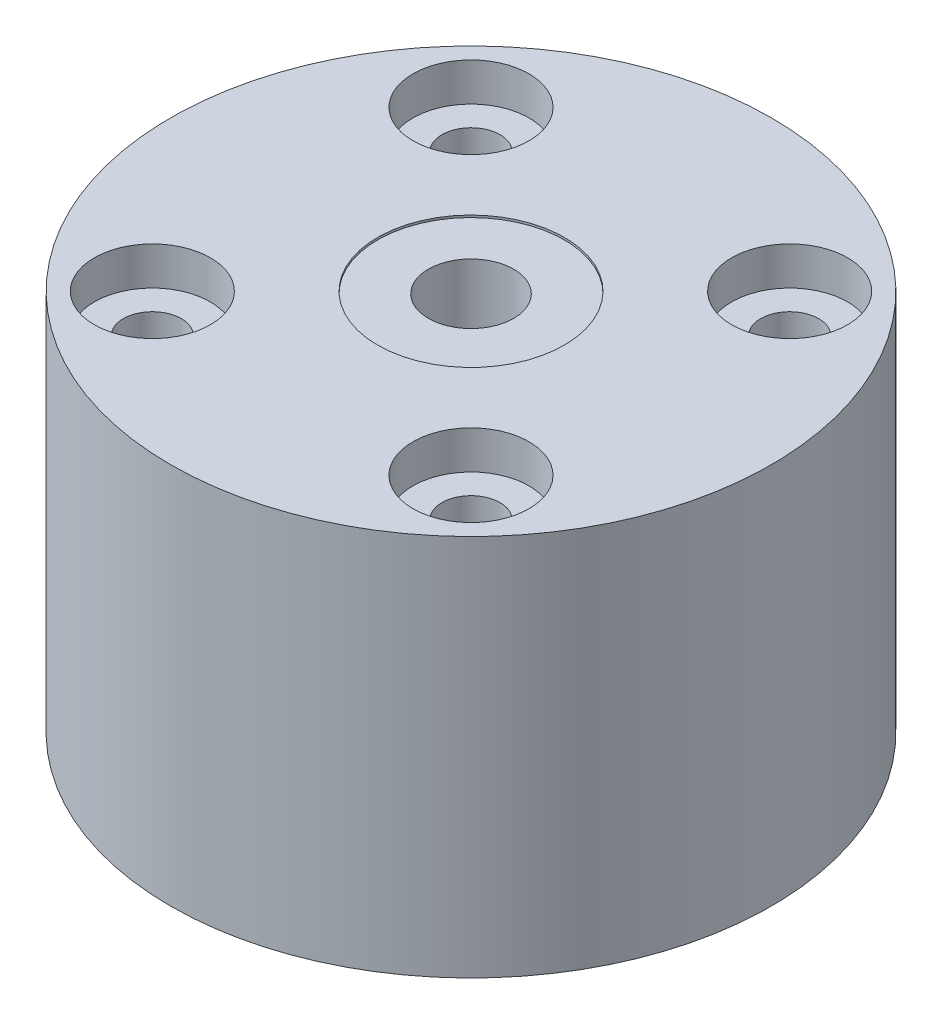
ISO-10303-21;
HEADER;
FILE_DESCRIPTION(('STEP AP214'),'2;1');
FILE_NAME('part.step','',(''),(''),'','','');
FILE_SCHEMA(('AUTOMOTIVE_DESIGN { 1 0 10303 214 1 1 1 1 }'));
ENDSEC;
DATA;
#1=APPLICATION_CONTEXT('core data for automotive mechanical design processes');
#2=APPLICATION_PROTOCOL_DEFINITION('international standard','automotive_design',2000,#1);
#3=PRODUCT_CONTEXT('',#1,'mechanical');
#4=PRODUCT('Part','Part','',(#3));
#5=PRODUCT_RELATED_PRODUCT_CATEGORY('part','',(#4));
#6=PRODUCT_DEFINITION_FORMATION('','',#4);
#7=PRODUCT_DEFINITION_CONTEXT('part definition',#1,'design');
#8=PRODUCT_DEFINITION('design','',#6,#7);
#9=PRODUCT_DEFINITION_SHAPE('','',#8);
#10=(LENGTH_UNIT() NAMED_UNIT(*) SI_UNIT(.MILLI.,.METRE.));
#11=(NAMED_UNIT(*) PLANE_ANGLE_UNIT() SI_UNIT($,.RADIAN.));
#12=(NAMED_UNIT(*) SI_UNIT($,.STERADIAN.) SOLID_ANGLE_UNIT());
#13=UNCERTAINTY_MEASURE_WITH_UNIT(LENGTH_MEASURE(1.E-05),#10,'distance_accuracy_value','');
#14=(GEOMETRIC_REPRESENTATION_CONTEXT(3) GLOBAL_UNCERTAINTY_ASSIGNED_CONTEXT((#13)) GLOBAL_UNIT_ASSIGNED_CONTEXT((#10,
#11,#12)) REPRESENTATION_CONTEXT('',''));
#15=CARTESIAN_POINT('',(0.,0.,0.));
#16=DIRECTION('',(0.,0.,1.));
#17=DIRECTION('',(1.,0.,0.));
#18=AXIS2_PLACEMENT_3D('',#15,#16,#17);
#19=CARTESIAN_POINT('',(0.,0.,0.));
#20=DIRECTION('',(0.,1.,0.));
#21=DIRECTION('',(0.,0.,1.));
#22=AXIS2_PLACEMENT_3D('',#19,#20,#21);
#23=CYLINDRICAL_SURFACE('',#22,4.96061999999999);
#24=CARTESIAN_POINT('',(0.,-26.19375,0.));
#25=DIRECTION('',(0.,-1.,0.));
#26=DIRECTION('',(0.,0.,-1.));
#27=AXIS2_PLACEMENT_3D('',#24,#25,#26);
#28=CIRCLE('',#27,4.96061999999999);
#29=CARTESIAN_POINT('',(0.,-26.19375,-4.96061999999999));
#30=VERTEX_POINT('',#29);
#31=EDGE_CURVE('E102',#30,#30,#28,.T.);
#32=ORIENTED_EDGE('',*,*,#31,.T.);
#33=EDGE_LOOP('',(#32));
#34=FACE_BOUND('',#33,.T.);
#35=CARTESIAN_POINT('',(0.,-0.254,0.));
#36=DIRECTION('',(0.,1.,0.));
#37=DIRECTION('',(0.,0.,1.));
#38=AXIS2_PLACEMENT_3D('',#35,#36,#37);
#39=CIRCLE('',#38,4.96061999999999);
#40=CARTESIAN_POINT('',(0.,-0.254,4.96061999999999));
#41=VERTEX_POINT('',#40);
#42=EDGE_CURVE('E38',#41,#41,#39,.F.);
#43=ORIENTED_EDGE('',*,*,#42,.F.);
#44=EDGE_LOOP('',(#43));
#45=FACE_BOUND('',#44,.T.);
#46=ADVANCED_FACE('F34',(#34,#45),#23,.F.);
#47=CARTESIAN_POINT('',(0.,-44.45,0.));
#48=DIRECTION('',(0.,1.,0.));
#49=DIRECTION('',(0.,0.,1.));
#50=AXIS2_PLACEMENT_3D('',#47,#48,#49);
#51=CYLINDRICAL_SURFACE('',#50,34.925);
#52=CARTESIAN_POINT('',(0.,-44.45,0.));
#53=DIRECTION('',(0.,1.,0.));
#54=DIRECTION('',(0.,0.,1.));
#55=AXIS2_PLACEMENT_3D('',#52,#53,#54);
#56=CIRCLE('',#55,34.925);
#57=CARTESIAN_POINT('',(0.,-44.45,34.925));
#58=VERTEX_POINT('',#57);
#59=EDGE_CURVE('E10',#58,#58,#56,.T.);
#60=CARTESIAN_POINT('',(0.,0.,0.));
#61=DIRECTION('',(0.,1.,0.));
#62=DIRECTION('',(0.,0.,1.));
#63=AXIS2_PLACEMENT_3D('',#60,#61,#62);
#64=CIRCLE('',#63,34.925);
#65=CARTESIAN_POINT('',(0.,0.,34.925));
#66=VERTEX_POINT('',#65);
#67=EDGE_CURVE('E42',#66,#66,#64,.T.);
#68=CARTESIAN_POINT('',(0.,-44.45,34.925));
#69=CARTESIAN_POINT('',(0.,-43.9869791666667,34.925));
#70=CARTESIAN_POINT('',(0.,-43.5239583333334,34.925));
#71=CARTESIAN_POINT('',(0.,-42.5979166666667,34.925));
#72=CARTESIAN_POINT('',(0.,-42.1348958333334,34.925));
#73=CARTESIAN_POINT('',(0.,-41.2088541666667,34.925));
#74=CARTESIAN_POINT('',(0.,-40.7458333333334,34.925));
#75=CARTESIAN_POINT('',(0.,-39.8197916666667,34.925));
#76=CARTESIAN_POINT('',(0.,-39.3567708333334,34.925));
#77=CARTESIAN_POINT('',(0.,-38.4307291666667,34.925));
#78=CARTESIAN_POINT('',(0.,-37.9677083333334,34.925));
#79=CARTESIAN_POINT('',(0.,-37.0416666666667,34.925));
#80=CARTESIAN_POINT('',(0.,-36.5786458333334,34.925));
#81=CARTESIAN_POINT('',(0.,-35.6526041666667,34.925));
#82=CARTESIAN_POINT('',(0.,-35.1895833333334,34.925));
#83=CARTESIAN_POINT('',(0.,-34.2635416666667,34.925));
#84=CARTESIAN_POINT('',(0.,-33.8005208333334,34.925));
#85=CARTESIAN_POINT('',(0.,-32.8744791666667,34.925));
#86=CARTESIAN_POINT('',(0.,-32.4114583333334,34.925));
#87=CARTESIAN_POINT('',(0.,-31.4854166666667,34.925));
#88=CARTESIAN_POINT('',(0.,-31.0223958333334,34.925));
#89=CARTESIAN_POINT('',(0.,-30.0963541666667,34.925));
#90=CARTESIAN_POINT('',(0.,-29.6333333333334,34.925));
#91=CARTESIAN_POINT('',(0.,-28.7072916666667,34.925));
#92=CARTESIAN_POINT('',(0.,-28.2442708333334,34.925));
#93=CARTESIAN_POINT('',(0.,-27.3182291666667,34.925));
#94=CARTESIAN_POINT('',(0.,-26.8552083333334,34.925));
#95=CARTESIAN_POINT('',(0.,-25.9291666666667,34.925));
#96=CARTESIAN_POINT('',(0.,-25.4661458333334,34.925));
#97=CARTESIAN_POINT('',(0.,-24.5401041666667,34.925));
#98=CARTESIAN_POINT('',(0.,-24.0770833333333,34.925));
#99=CARTESIAN_POINT('',(0.,-23.1510416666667,34.925));
#100=CARTESIAN_POINT('',(0.,-22.6880208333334,34.925));
#101=CARTESIAN_POINT('',(0.,-21.7619791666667,34.925));
#102=CARTESIAN_POINT('',(0.,-21.2989583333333,34.925));
#103=CARTESIAN_POINT('',(0.,-20.3729166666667,34.925));
#104=CARTESIAN_POINT('',(0.,-19.9098958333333,34.925));
#105=CARTESIAN_POINT('',(0.,-18.9838541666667,34.925));
#106=CARTESIAN_POINT('',(0.,-18.5208333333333,34.925));
#107=CARTESIAN_POINT('',(0.,-17.5947916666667,34.925));
#108=CARTESIAN_POINT('',(0.,-17.1317708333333,34.925));
#109=CARTESIAN_POINT('',(0.,-16.2057291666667,34.925));
#110=CARTESIAN_POINT('',(0.,-15.7427083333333,34.925));
#111=CARTESIAN_POINT('',(0.,-14.8166666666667,34.925));
#112=CARTESIAN_POINT('',(0.,-14.3536458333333,34.925));
#113=CARTESIAN_POINT('',(0.,-13.4276041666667,34.925));
#114=CARTESIAN_POINT('',(0.,-12.9645833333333,34.925));
#115=CARTESIAN_POINT('',(0.,-12.0385416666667,34.925));
#116=CARTESIAN_POINT('',(0.,-11.5755208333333,34.925));
#117=CARTESIAN_POINT('',(0.,-10.6494791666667,34.925));
#118=CARTESIAN_POINT('',(0.,-10.1864583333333,34.925));
#119=CARTESIAN_POINT('',(0.,-9.26041666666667,34.925));
#120=CARTESIAN_POINT('',(0.,-8.79739583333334,34.925));
#121=CARTESIAN_POINT('',(0.,-7.87135416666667,34.925));
#122=CARTESIAN_POINT('',(0.,-7.40833333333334,34.925));
#123=CARTESIAN_POINT('',(0.,-6.48229166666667,34.925));
#124=CARTESIAN_POINT('',(0.,-6.01927083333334,34.925));
#125=CARTESIAN_POINT('',(0.,-5.09322916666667,34.925));
#126=CARTESIAN_POINT('',(0.,-4.63020833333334,34.925));
#127=CARTESIAN_POINT('',(0.,-3.70416666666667,34.925));
#128=CARTESIAN_POINT('',(0.,-3.24114583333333,34.925));
#129=CARTESIAN_POINT('',(0.,-2.31510416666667,34.925));
#130=CARTESIAN_POINT('',(0.,-1.85208333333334,34.925));
#131=CARTESIAN_POINT('',(0.,-0.926041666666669,34.925));
#132=CARTESIAN_POINT('',(0.,-0.463020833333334,34.925));
#133=CARTESIAN_POINT('',(0.,0.,34.925));
#134=B_SPLINE_CURVE_WITH_KNOTS('',3,(#68,#69,#70,#71,#72,#73,#74,#75,#76,#77,#78,#79,#80,#81,
#82,#83,#84,#85,#86,#87,#88,#89,#90,#91,#92,#93,#94,#95,#96,#97,#98,#99,#100,#101,#102,#103,
#104,#105,#106,#107,#108,#109,#110,#111,#112,#113,#114,#115,#116,#117,#118,#119,#120,#121,#122,
#123,#124,#125,#126,#127,#128,#129,#130,#131,#132,#133),.UNSPECIFIED.,.F.,.F.,(4,2,2,2,2,2,2,2,
2,2,2,2,2,2,2,2,2,2,2,2,2,2,2,2,2,2,2,2,2,2,2,2,4),(0.,1.3890625,2.778125,4.1671875,5.55625,
6.9453125,8.334375,9.7234375,11.1125,12.5015625,13.890625,15.2796875,16.66875,18.0578125,
19.446875,20.8359375,22.225,23.6140625,25.003125,26.3921875,27.78125,29.1703125,30.559375,
31.9484375,33.3375,34.7265625,36.115625,37.5046875,38.89375,40.2828125,41.671875,43.0609375,
44.45),.UNSPECIFIED.);
#135=EDGE_CURVE('BSEAM36',#58,#66,#134,.T.);
#136=ORIENTED_EDGE('',*,*,#59,.T.);
#137=ORIENTED_EDGE('',*,*,#67,.F.);
#138=ORIENTED_EDGE('',*,*,#135,.T.);
#139=ORIENTED_EDGE('',*,*,#135,.F.);
#140=EDGE_LOOP('',(#136,#138,#137,#139));
#141=FACE_BOUND('',#140,.T.);
#142=ADVANCED_FACE('F36',(#141),#51,.T.);
#143=CARTESIAN_POINT('',(0.,-44.45,0.));
#144=DIRECTION('',(0.,1.,0.));
#145=DIRECTION('',(0.,0.,1.));
#146=AXIS2_PLACEMENT_3D('',#143,#144,#145);
#147=PLANE('',#146);
#148=CARTESIAN_POINT('',(18.5217782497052,-44.45,18.5217782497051));
#149=DIRECTION('',(0.,1.,0.));
#150=DIRECTION('',(0.,0.,1.));
#151=AXIS2_PLACEMENT_3D('',#148,#149,#150);
#152=CIRCLE('',#151,3.37819999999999);
#153=CARTESIAN_POINT('',(18.5217782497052,-44.45,21.8999782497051));
#154=VERTEX_POINT('',#153);
#155=EDGE_CURVE('E90',#154,#154,#152,.T.);
#156=ORIENTED_EDGE('',*,*,#155,.T.);
#157=EDGE_LOOP('',(#156));
#158=FACE_BOUND('',#157,.T.);
#159=CARTESIAN_POINT('',(18.5217782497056,-44.45,-18.5217782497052));
#160=DIRECTION('',(0.,1.,0.));
#161=DIRECTION('',(0.,0.,1.));
#162=AXIS2_PLACEMENT_3D('',#159,#160,#161);
#163=CIRCLE('',#162,3.37819999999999);
#164=CARTESIAN_POINT('',(18.5217782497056,-44.45,-15.1435782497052));
#165=VERTEX_POINT('',#164);
#166=EDGE_CURVE('E78',#165,#165,#163,.T.);
#167=ORIENTED_EDGE('',*,*,#166,.T.);
#168=EDGE_LOOP('',(#167));
#169=FACE_BOUND('',#168,.T.);
#170=CARTESIAN_POINT('',(-18.5217782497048,-44.45,-18.5217782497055));
#171=DIRECTION('',(0.,1.,0.));
#172=DIRECTION('',(0.,0.,1.));
#173=AXIS2_PLACEMENT_3D('',#170,#171,#172);
#174=CIRCLE('',#173,3.37819999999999);
#175=CARTESIAN_POINT('',(-18.5217782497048,-44.45,-15.1435782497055));
#176=VERTEX_POINT('',#175);
#177=EDGE_CURVE('E66',#176,#176,#174,.T.);
#178=ORIENTED_EDGE('',*,*,#177,.T.);
#179=EDGE_LOOP('',(#178));
#180=FACE_BOUND('',#179,.T.);
#181=CARTESIAN_POINT('',(-18.5217782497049,-44.45,18.5217782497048));
#182=DIRECTION('',(0.,1.,0.));
#183=DIRECTION('',(0.,0.,1.));
#184=AXIS2_PLACEMENT_3D('',#181,#182,#183);
#185=CIRCLE('',#184,3.37819999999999);
#186=CARTESIAN_POINT('',(-18.5217782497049,-44.45,21.8999782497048));
#187=VERTEX_POINT('',#186);
#188=EDGE_CURVE('E52',#187,#187,#185,.T.);
#189=ORIENTED_EDGE('',*,*,#188,.T.);
#190=EDGE_LOOP('',(#189));
#191=FACE_BOUND('',#190,.T.);
#192=CARTESIAN_POINT('',(0.,-44.45,0.));
#193=DIRECTION('',(0.,-1.,0.));
#194=DIRECTION('',(0.,0.,-1.));
#195=AXIS2_PLACEMENT_3D('',#192,#193,#194);
#196=CIRCLE('',#195,14.8451122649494);
#197=CARTESIAN_POINT('',(0.,-44.45,-14.8451122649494));
#198=VERTEX_POINT('',#197);
#199=EDGE_CURVE('E49',#198,#198,#196,.T.);
#200=ORIENTED_EDGE('',*,*,#199,.F.);
#201=EDGE_LOOP('',(#200));
#202=FACE_BOUND('',#201,.T.);
#203=ORIENTED_EDGE('',*,*,#59,.F.);
#204=EDGE_LOOP('',(#203));
#205=FACE_BOUND('',#204,.T.);
#206=ADVANCED_FACE('F123',(#158,#169,#180,#191,#202,#205),#147,.F.);
#207=CARTESIAN_POINT('',(0.,0.,0.));
#208=DIRECTION('',(0.,1.,0.));
#209=DIRECTION('',(0.,0.,1.));
#210=AXIS2_PLACEMENT_3D('',#207,#208,#209);
#211=PLANE('',#210);
#212=CARTESIAN_POINT('',(0.,0.,0.));
#213=DIRECTION('',(0.,1.,0.));
#214=DIRECTION('',(0.,0.,1.));
#215=AXIS2_PLACEMENT_3D('',#212,#213,#214);
#216=CIRCLE('',#215,10.8531939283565);
#217=CARTESIAN_POINT('',(0.,0.,10.8531939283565));
#218=VERTEX_POINT('',#217);
#219=EDGE_CURVE('E105',#218,#218,#216,.T.);
#220=ORIENTED_EDGE('',*,*,#219,.F.);
#221=EDGE_LOOP('',(#220));
#222=FACE_BOUND('',#221,.T.);
#223=CARTESIAN_POINT('',(18.5217782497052,0.,18.5217782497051));
#224=DIRECTION('',(0.,1.,0.));
#225=DIRECTION('',(0.,0.,1.));
#226=AXIS2_PLACEMENT_3D('',#223,#224,#225);
#227=CIRCLE('',#226,6.74624);
#228=CARTESIAN_POINT('',(18.5217782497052,0.,25.2680182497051));
#229=VERTEX_POINT('',#228);
#230=EDGE_CURVE('E99',#229,#229,#227,.T.);
#231=ORIENTED_EDGE('',*,*,#230,.F.);
#232=EDGE_LOOP('',(#231));
#233=FACE_BOUND('',#232,.T.);
#234=CARTESIAN_POINT('',(18.5217782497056,0.,-18.5217782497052));
#235=DIRECTION('',(0.,1.,0.));
#236=DIRECTION('',(0.,0.,1.));
#237=AXIS2_PLACEMENT_3D('',#234,#235,#236);
#238=CIRCLE('',#237,6.74624);
#239=CARTESIAN_POINT('',(18.5217782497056,0.,-11.7755382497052));
#240=VERTEX_POINT('',#239);
#241=EDGE_CURVE('E87',#240,#240,#238,.T.);
#242=ORIENTED_EDGE('',*,*,#241,.F.);
#243=EDGE_LOOP('',(#242));
#244=FACE_BOUND('',#243,.T.);
#245=CARTESIAN_POINT('',(-18.5217782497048,0.,-18.5217782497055));
#246=DIRECTION('',(0.,1.,0.));
#247=DIRECTION('',(0.,0.,1.));
#248=AXIS2_PLACEMENT_3D('',#245,#246,#247);
#249=CIRCLE('',#248,6.74624);
#250=CARTESIAN_POINT('',(-18.5217782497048,0.,-11.7755382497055));
#251=VERTEX_POINT('',#250);
#252=EDGE_CURVE('E75',#251,#251,#249,.T.);
#253=ORIENTED_EDGE('',*,*,#252,.F.);
#254=EDGE_LOOP('',(#253));
#255=FACE_BOUND('',#254,.T.);
#256=CARTESIAN_POINT('',(-18.5217782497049,0.,18.5217782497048));
#257=DIRECTION('',(0.,1.,0.));
#258=DIRECTION('',(0.,0.,1.));
#259=AXIS2_PLACEMENT_3D('',#256,#257,#258);
#260=CIRCLE('',#259,6.74624);
#261=CARTESIAN_POINT('',(-18.5217782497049,0.,25.2680182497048));
#262=VERTEX_POINT('',#261);
#263=EDGE_CURVE('E63',#262,#262,#260,.T.);
#264=ORIENTED_EDGE('',*,*,#263,.F.);
#265=EDGE_LOOP('',(#264));
#266=FACE_BOUND('',#265,.T.);
#267=ORIENTED_EDGE('',*,*,#67,.T.);
#268=EDGE_LOOP('',(#267));
#269=FACE_BOUND('',#268,.T.);
#270=ADVANCED_FACE('F183',(#222,#233,#244,#255,#266,#269),#211,.T.);
#271=CARTESIAN_POINT('',(0.,-26.19375,0.));
#272=DIRECTION('',(0.,-1.,0.));
#273=DIRECTION('',(0.,0.,-1.));
#274=AXIS2_PLACEMENT_3D('',#271,#272,#273);
#275=CYLINDRICAL_SURFACE('',#274,14.8451122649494);
#276=CARTESIAN_POINT('',(0.,-26.19375,0.));
#277=DIRECTION('',(0.,-1.,0.));
#278=DIRECTION('',(0.,0.,-1.));
#279=AXIS2_PLACEMENT_3D('',#276,#277,#278);
#280=CIRCLE('',#279,14.8451122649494);
#281=CARTESIAN_POINT('',(0.,-26.19375,-14.8451122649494));
#282=VERTEX_POINT('',#281);
#283=EDGE_CURVE('E47',#282,#282,#280,.T.);
#284=CARTESIAN_POINT('',(0.,-26.19375,-14.8451122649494));
#285=CARTESIAN_POINT('',(0.,-26.3839192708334,-14.8451122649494));
#286=CARTESIAN_POINT('',(0.,-26.5740885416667,-14.8451122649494));
#287=CARTESIAN_POINT('',(0.,-26.9544270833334,-14.8451122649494));
#288=CARTESIAN_POINT('',(0.,-27.1445963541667,-14.8451122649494));
#289=CARTESIAN_POINT('',(0.,-27.5249348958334,-14.8451122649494));
#290=CARTESIAN_POINT('',(0.,-27.7151041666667,-14.8451122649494));
#291=CARTESIAN_POINT('',(0.,-28.0954427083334,-14.8451122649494));
#292=CARTESIAN_POINT('',(0.,-28.2856119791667,-14.8451122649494));
#293=CARTESIAN_POINT('',(0.,-28.6659505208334,-14.8451122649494));
#294=CARTESIAN_POINT('',(0.,-28.8561197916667,-14.8451122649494));
#295=CARTESIAN_POINT('',(0.,-29.2364583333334,-14.8451122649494));
#296=CARTESIAN_POINT('',(0.,-29.4266276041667,-14.8451122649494));
#297=CARTESIAN_POINT('',(0.,-29.8069661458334,-14.8451122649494));
#298=CARTESIAN_POINT('',(0.,-29.9971354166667,-14.8451122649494));
#299=CARTESIAN_POINT('',(0.,-30.3774739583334,-14.8451122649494));
#300=CARTESIAN_POINT('',(0.,-30.5676432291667,-14.8451122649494));
#301=CARTESIAN_POINT('',(0.,-30.9479817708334,-14.8451122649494));
#302=CARTESIAN_POINT('',(0.,-31.1381510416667,-14.8451122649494));
#303=CARTESIAN_POINT('',(0.,-31.5184895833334,-14.8451122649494));
#304=CARTESIAN_POINT('',(0.,-31.7086588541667,-14.8451122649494));
#305=CARTESIAN_POINT('',(0.,-32.0889973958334,-14.8451122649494));
#306=CARTESIAN_POINT('',(0.,-32.2791666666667,-14.8451122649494));
#307=CARTESIAN_POINT('',(0.,-32.6595052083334,-14.8451122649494));
#308=CARTESIAN_POINT('',(0.,-32.8496744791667,-14.8451122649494));
#309=CARTESIAN_POINT('',(0.,-33.2300130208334,-14.8451122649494));
#310=CARTESIAN_POINT('',(0.,-33.4201822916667,-14.8451122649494));
#311=CARTESIAN_POINT('',(0.,-33.8005208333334,-14.8451122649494));
#312=CARTESIAN_POINT('',(0.,-33.9906901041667,-14.8451122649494));
#313=CARTESIAN_POINT('',(0.,-34.3710286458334,-14.8451122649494));
#314=CARTESIAN_POINT('',(0.,-34.5611979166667,-14.8451122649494));
#315=CARTESIAN_POINT('',(0.,-34.9415364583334,-14.8451122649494));
#316=CARTESIAN_POINT('',(0.,-35.1317057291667,-14.8451122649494));
#317=CARTESIAN_POINT('',(0.,-35.5120442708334,-14.8451122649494));
#318=CARTESIAN_POINT('',(0.,-35.7022135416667,-14.8451122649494));
#319=CARTESIAN_POINT('',(0.,-36.0825520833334,-14.8451122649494));
#320=CARTESIAN_POINT('',(0.,-36.2727213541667,-14.8451122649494));
#321=CARTESIAN_POINT('',(0.,-36.6530598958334,-14.8451122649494));
#322=CARTESIAN_POINT('',(0.,-36.8432291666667,-14.8451122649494));
#323=CARTESIAN_POINT('',(0.,-37.2235677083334,-14.8451122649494));
#324=CARTESIAN_POINT('',(0.,-37.4137369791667,-14.8451122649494));
#325=CARTESIAN_POINT('',(0.,-37.7940755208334,-14.8451122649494));
#326=CARTESIAN_POINT('',(0.,-37.9842447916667,-14.8451122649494));
#327=CARTESIAN_POINT('',(0.,-38.3645833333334,-14.8451122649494));
#328=CARTESIAN_POINT('',(0.,-38.5547526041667,-14.8451122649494));
#329=CARTESIAN_POINT('',(0.,-38.9350911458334,-14.8451122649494));
#330=CARTESIAN_POINT('',(0.,-39.1252604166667,-14.8451122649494));
#331=CARTESIAN_POINT('',(0.,-39.5055989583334,-14.8451122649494));
#332=CARTESIAN_POINT('',(0.,-39.6957682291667,-14.8451122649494));
#333=CARTESIAN_POINT('',(0.,-40.0761067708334,-14.8451122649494));
#334=CARTESIAN_POINT('',(0.,-40.2662760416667,-14.8451122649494));
#335=CARTESIAN_POINT('',(0.,-40.6466145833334,-14.8451122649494));
#336=CARTESIAN_POINT('',(0.,-40.8367838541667,-14.8451122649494));
#337=CARTESIAN_POINT('',(0.,-41.2171223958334,-14.8451122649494));
#338=CARTESIAN_POINT('',(0.,-41.4072916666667,-14.8451122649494));
#339=CARTESIAN_POINT('',(0.,-41.7876302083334,-14.8451122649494));
#340=CARTESIAN_POINT('',(0.,-41.9777994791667,-14.8451122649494));
#341=CARTESIAN_POINT('',(0.,-42.3581380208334,-14.8451122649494));
#342=CARTESIAN_POINT('',(0.,-42.5483072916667,-14.8451122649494));
#343=CARTESIAN_POINT('',(0.,-42.9286458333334,-14.8451122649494));
#344=CARTESIAN_POINT('',(0.,-43.1188151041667,-14.8451122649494));
#345=CARTESIAN_POINT('',(0.,-43.4991536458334,-14.8451122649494));
#346=CARTESIAN_POINT('',(0.,-43.6893229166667,-14.8451122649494));
#347=CARTESIAN_POINT('',(0.,-44.0696614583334,-14.8451122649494));
#348=CARTESIAN_POINT('',(0.,-44.2598307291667,-14.8451122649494));
#349=CARTESIAN_POINT('',(0.,-44.45,-14.8451122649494));
#350=B_SPLINE_CURVE_WITH_KNOTS('',3,(#284,#285,#286,#287,#288,#289,#290,#291,#292,#293,#294,
#295,#296,#297,#298,#299,#300,#301,#302,#303,#304,#305,#306,#307,#308,#309,#310,#311,#312,#313,
#314,#315,#316,#317,#318,#319,#320,#321,#322,#323,#324,#325,#326,#327,#328,#329,#330,#331,#332,
#333,#334,#335,#336,#337,#338,#339,#340,#341,#342,#343,#344,#345,#346,#347,#348,#349),
.UNSPECIFIED.,.F.,.F.,(4,2,2,2,2,2,2,2,2,2,2,2,2,2,2,2,2,2,2,2,2,2,2,2,2,2,2,2,2,2,2,2,4),(0.,
0.570507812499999,1.141015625,1.7115234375,2.28203125,2.8525390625,3.423046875,3.99355468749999,
4.5640625,5.1345703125,5.705078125,6.2755859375,6.84609374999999,7.4166015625,7.98710937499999,
8.55761718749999,9.128125,9.69863281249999,10.269140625,10.8396484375,11.41015625,11.9806640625,
12.551171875,13.1216796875,13.6921875,14.2626953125,14.833203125,15.4037109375,15.97421875,
16.5447265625,17.115234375,17.6857421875,18.25625),.UNSPECIFIED.);
#351=EDGE_CURVE('BSEAM179',#282,#198,#350,.T.);
#352=ORIENTED_EDGE('',*,*,#283,.F.);
#353=ORIENTED_EDGE('',*,*,#199,.T.);
#354=ORIENTED_EDGE('',*,*,#351,.T.);
#355=ORIENTED_EDGE('',*,*,#351,.F.);
#356=EDGE_LOOP('',(#352,#354,#353,#355));
#357=FACE_BOUND('',#356,.T.);
#358=ADVANCED_FACE('F179',(#357),#275,.F.);
#359=CARTESIAN_POINT('',(0.,-26.19375,0.));
#360=DIRECTION('',(0.,-1.,0.));
#361=DIRECTION('',(0.,0.,-1.));
#362=AXIS2_PLACEMENT_3D('',#359,#360,#361);
#363=PLANE('',#362);
#364=ORIENTED_EDGE('',*,*,#31,.F.);
#365=EDGE_LOOP('',(#364));
#366=FACE_BOUND('',#365,.T.);
#367=ORIENTED_EDGE('',*,*,#283,.T.);
#368=EDGE_LOOP('',(#367));
#369=FACE_BOUND('',#368,.T.);
#370=ADVANCED_FACE('F175',(#366,#369),#363,.T.);
#371=CARTESIAN_POINT('',(-18.5217782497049,0.,18.5217782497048));
#372=DIRECTION('',(0.,1.,0.));
#373=DIRECTION('',(0.,0.,1.));
#374=AXIS2_PLACEMENT_3D('',#371,#372,#373);
#375=CYLINDRICAL_SURFACE('',#374,3.3782);
#376=ORIENTED_EDGE('',*,*,#188,.F.);
#377=EDGE_LOOP('',(#376));
#378=FACE_BOUND('',#377,.T.);
#379=CARTESIAN_POINT('',(-18.5217782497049,-4.445,18.5217782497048));
#380=DIRECTION('',(0.,1.,0.));
#381=DIRECTION('',(0.,0.,1.));
#382=AXIS2_PLACEMENT_3D('',#379,#380,#381);
#383=CIRCLE('',#382,3.3782);
#384=CARTESIAN_POINT('',(-18.5217782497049,-4.445,21.8999782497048));
#385=VERTEX_POINT('',#384);
#386=EDGE_CURVE('E57',#385,#385,#383,.T.);
#387=ORIENTED_EDGE('',*,*,#386,.T.);
#388=EDGE_LOOP('',(#387));
#389=FACE_BOUND('',#388,.T.);
#390=ADVANCED_FACE('F171',(#378,#389),#375,.F.);
#391=CARTESIAN_POINT('',(-15.1435782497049,-4.445,18.5217782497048));
#392=DIRECTION('',(0.,-1.,0.));
#393=DIRECTION('',(0.,0.,-1.));
#394=AXIS2_PLACEMENT_3D('',#391,#392,#393);
#395=PLANE('',#394);
#396=ORIENTED_EDGE('',*,*,#386,.F.);
#397=EDGE_LOOP('',(#396));
#398=FACE_BOUND('',#397,.T.);
#399=CARTESIAN_POINT('',(-18.5217782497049,-4.445,18.5217782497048));
#400=DIRECTION('',(0.,1.,0.));
#401=DIRECTION('',(0.,0.,1.));
#402=AXIS2_PLACEMENT_3D('',#399,#400,#401);
#403=CIRCLE('',#402,6.74624);
#404=CARTESIAN_POINT('',(-18.5217782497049,-4.445,25.2680182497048));
#405=VERTEX_POINT('',#404);
#406=EDGE_CURVE('E60',#405,#405,#403,.T.);
#407=ORIENTED_EDGE('',*,*,#406,.T.);
#408=EDGE_LOOP('',(#407));
#409=FACE_BOUND('',#408,.T.);
#410=ADVANCED_FACE('F167',(#398,#409),#395,.F.);
#411=CARTESIAN_POINT('',(-18.5217782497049,0.,18.5217782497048));
#412=DIRECTION('',(0.,1.,0.));
#413=DIRECTION('',(0.,0.,1.));
#414=AXIS2_PLACEMENT_3D('',#411,#412,#413);
#415=CYLINDRICAL_SURFACE('',#414,6.74624);
#416=ORIENTED_EDGE('',*,*,#406,.F.);
#417=EDGE_LOOP('',(#416));
#418=FACE_BOUND('',#417,.T.);
#419=ORIENTED_EDGE('',*,*,#263,.T.);
#420=EDGE_LOOP('',(#419));
#421=FACE_BOUND('',#420,.T.);
#422=ADVANCED_FACE('F163',(#418,#421),#415,.F.);
#423=CARTESIAN_POINT('',(-18.5217782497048,0.,-18.5217782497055));
#424=DIRECTION('',(0.,1.,0.));
#425=DIRECTION('',(0.,0.,1.));
#426=AXIS2_PLACEMENT_3D('',#423,#424,#425);
#427=CYLINDRICAL_SURFACE('',#426,3.3782);
#428=ORIENTED_EDGE('',*,*,#177,.F.);
#429=EDGE_LOOP('',(#428));
#430=FACE_BOUND('',#429,.T.);
#431=CARTESIAN_POINT('',(-18.5217782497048,-4.445,-18.5217782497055));
#432=DIRECTION('',(0.,1.,0.));
#433=DIRECTION('',(0.,0.,1.));
#434=AXIS2_PLACEMENT_3D('',#431,#432,#433);
#435=CIRCLE('',#434,3.3782);
#436=CARTESIAN_POINT('',(-18.5217782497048,-4.445,-15.1435782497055));
#437=VERTEX_POINT('',#436);
#438=EDGE_CURVE('E69',#437,#437,#435,.T.);
#439=ORIENTED_EDGE('',*,*,#438,.T.);
#440=EDGE_LOOP('',(#439));
#441=FACE_BOUND('',#440,.T.);
#442=ADVANCED_FACE('F159',(#430,#441),#427,.F.);
#443=CARTESIAN_POINT('',(-15.1435782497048,-4.445,-18.5217782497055));
#444=DIRECTION('',(0.,-1.,0.));
#445=DIRECTION('',(0.,0.,-1.));
#446=AXIS2_PLACEMENT_3D('',#443,#444,#445);
#447=PLANE('',#446);
#448=ORIENTED_EDGE('',*,*,#438,.F.);
#449=EDGE_LOOP('',(#448));
#450=FACE_BOUND('',#449,.T.);
#451=CARTESIAN_POINT('',(-18.5217782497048,-4.445,-18.5217782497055));
#452=DIRECTION('',(0.,1.,0.));
#453=DIRECTION('',(0.,0.,1.));
#454=AXIS2_PLACEMENT_3D('',#451,#452,#453);
#455=CIRCLE('',#454,6.74624);
#456=CARTESIAN_POINT('',(-18.5217782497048,-4.445,-11.7755382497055));
#457=VERTEX_POINT('',#456);
#458=EDGE_CURVE('E72',#457,#457,#455,.T.);
#459=ORIENTED_EDGE('',*,*,#458,.T.);
#460=EDGE_LOOP('',(#459));
#461=FACE_BOUND('',#460,.T.);
#462=ADVANCED_FACE('F155',(#450,#461),#447,.F.);
#463=CARTESIAN_POINT('',(-18.5217782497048,0.,-18.5217782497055));
#464=DIRECTION('',(0.,1.,0.));
#465=DIRECTION('',(0.,0.,1.));
#466=AXIS2_PLACEMENT_3D('',#463,#464,#465);
#467=CYLINDRICAL_SURFACE('',#466,6.74624);
#468=ORIENTED_EDGE('',*,*,#458,.F.);
#469=EDGE_LOOP('',(#468));
#470=FACE_BOUND('',#469,.T.);
#471=ORIENTED_EDGE('',*,*,#252,.T.);
#472=EDGE_LOOP('',(#471));
#473=FACE_BOUND('',#472,.T.);
#474=ADVANCED_FACE('F151',(#470,#473),#467,.F.);
#475=CARTESIAN_POINT('',(18.5217782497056,0.,-18.5217782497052));
#476=DIRECTION('',(0.,1.,0.));
#477=DIRECTION('',(0.,0.,1.));
#478=AXIS2_PLACEMENT_3D('',#475,#476,#477);
#479=CYLINDRICAL_SURFACE('',#478,3.3782);
#480=ORIENTED_EDGE('',*,*,#166,.F.);
#481=EDGE_LOOP('',(#480));
#482=FACE_BOUND('',#481,.T.);
#483=CARTESIAN_POINT('',(18.5217782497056,-4.445,-18.5217782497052));
#484=DIRECTION('',(0.,1.,0.));
#485=DIRECTION('',(0.,0.,1.));
#486=AXIS2_PLACEMENT_3D('',#483,#484,#485);
#487=CIRCLE('',#486,3.3782);
#488=CARTESIAN_POINT('',(18.5217782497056,-4.445,-15.1435782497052));
#489=VERTEX_POINT('',#488);
#490=EDGE_CURVE('E81',#489,#489,#487,.T.);
#491=ORIENTED_EDGE('',*,*,#490,.T.);
#492=EDGE_LOOP('',(#491));
#493=FACE_BOUND('',#492,.T.);
#494=ADVANCED_FACE('F147',(#482,#493),#479,.F.);
#495=CARTESIAN_POINT('',(21.8999782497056,-4.445,-18.5217782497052));
#496=DIRECTION('',(0.,-1.,0.));
#497=DIRECTION('',(0.,0.,-1.));
#498=AXIS2_PLACEMENT_3D('',#495,#496,#497);
#499=PLANE('',#498);
#500=ORIENTED_EDGE('',*,*,#490,.F.);
#501=EDGE_LOOP('',(#500));
#502=FACE_BOUND('',#501,.T.);
#503=CARTESIAN_POINT('',(18.5217782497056,-4.445,-18.5217782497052));
#504=DIRECTION('',(0.,1.,0.));
#505=DIRECTION('',(0.,0.,1.));
#506=AXIS2_PLACEMENT_3D('',#503,#504,#505);
#507=CIRCLE('',#506,6.74624);
#508=CARTESIAN_POINT('',(18.5217782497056,-4.445,-11.7755382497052));
#509=VERTEX_POINT('',#508);
#510=EDGE_CURVE('E84',#509,#509,#507,.T.);
#511=ORIENTED_EDGE('',*,*,#510,.T.);
#512=EDGE_LOOP('',(#511));
#513=FACE_BOUND('',#512,.T.);
#514=ADVANCED_FACE('F143',(#502,#513),#499,.F.);
#515=CARTESIAN_POINT('',(18.5217782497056,0.,-18.5217782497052));
#516=DIRECTION('',(0.,1.,0.));
#517=DIRECTION('',(0.,0.,1.));
#518=AXIS2_PLACEMENT_3D('',#515,#516,#517);
#519=CYLINDRICAL_SURFACE('',#518,6.74624);
#520=ORIENTED_EDGE('',*,*,#510,.F.);
#521=EDGE_LOOP('',(#520));
#522=FACE_BOUND('',#521,.T.);
#523=ORIENTED_EDGE('',*,*,#241,.T.);
#524=EDGE_LOOP('',(#523));
#525=FACE_BOUND('',#524,.T.);
#526=ADVANCED_FACE('F139',(#522,#525),#519,.F.);
#527=CARTESIAN_POINT('',(18.5217782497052,0.,18.5217782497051));
#528=DIRECTION('',(0.,1.,0.));
#529=DIRECTION('',(0.,0.,1.));
#530=AXIS2_PLACEMENT_3D('',#527,#528,#529);
#531=CYLINDRICAL_SURFACE('',#530,3.3782);
#532=ORIENTED_EDGE('',*,*,#155,.F.);
#533=EDGE_LOOP('',(#532));
#534=FACE_BOUND('',#533,.T.);
#535=CARTESIAN_POINT('',(18.5217782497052,-4.445,18.5217782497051));
#536=DIRECTION('',(0.,1.,0.));
#537=DIRECTION('',(0.,0.,1.));
#538=AXIS2_PLACEMENT_3D('',#535,#536,#537);
#539=CIRCLE('',#538,3.3782);
#540=CARTESIAN_POINT('',(18.5217782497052,-4.445,21.8999782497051));
#541=VERTEX_POINT('',#540);
#542=EDGE_CURVE('E93',#541,#541,#539,.T.);
#543=ORIENTED_EDGE('',*,*,#542,.T.);
#544=EDGE_LOOP('',(#543));
#545=FACE_BOUND('',#544,.T.);
#546=ADVANCED_FACE('F135',(#534,#545),#531,.F.);
#547=CARTESIAN_POINT('',(21.8999782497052,-4.445,18.5217782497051));
#548=DIRECTION('',(0.,-1.,0.));
#549=DIRECTION('',(0.,0.,-1.));
#550=AXIS2_PLACEMENT_3D('',#547,#548,#549);
#551=PLANE('',#550);
#552=ORIENTED_EDGE('',*,*,#542,.F.);
#553=EDGE_LOOP('',(#552));
#554=FACE_BOUND('',#553,.T.);
#555=CARTESIAN_POINT('',(18.5217782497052,-4.445,18.5217782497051));
#556=DIRECTION('',(0.,1.,0.));
#557=DIRECTION('',(0.,0.,1.));
#558=AXIS2_PLACEMENT_3D('',#555,#556,#557);
#559=CIRCLE('',#558,6.74624);
#560=CARTESIAN_POINT('',(18.5217782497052,-4.445,25.2680182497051));
#561=VERTEX_POINT('',#560);
#562=EDGE_CURVE('E96',#561,#561,#559,.T.);
#563=ORIENTED_EDGE('',*,*,#562,.T.);
#564=EDGE_LOOP('',(#563));
#565=FACE_BOUND('',#564,.T.);
#566=ADVANCED_FACE('F131',(#554,#565),#551,.F.);
#567=CARTESIAN_POINT('',(18.5217782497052,0.,18.5217782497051));
#568=DIRECTION('',(0.,1.,0.));
#569=DIRECTION('',(0.,0.,1.));
#570=AXIS2_PLACEMENT_3D('',#567,#568,#569);
#571=CYLINDRICAL_SURFACE('',#570,6.74624);
#572=ORIENTED_EDGE('',*,*,#562,.F.);
#573=EDGE_LOOP('',(#572));
#574=FACE_BOUND('',#573,.T.);
#575=ORIENTED_EDGE('',*,*,#230,.T.);
#576=EDGE_LOOP('',(#575));
#577=FACE_BOUND('',#576,.T.);
#578=ADVANCED_FACE('F128',(#574,#577),#571,.F.);
#579=CARTESIAN_POINT('',(0.,-0.254,0.));
#580=DIRECTION('',(0.,1.,0.));
#581=DIRECTION('',(0.,0.,1.));
#582=AXIS2_PLACEMENT_3D('',#579,#580,#581);
#583=PLANE('',#582);
#584=CARTESIAN_POINT('',(0.,-0.254,0.));
#585=DIRECTION('',(0.,1.,0.));
#586=DIRECTION('',(0.,0.,1.));
#587=AXIS2_PLACEMENT_3D('',#584,#585,#586);
#588=CIRCLE('',#587,10.8531939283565);
#589=CARTESIAN_POINT('',(0.,-0.254,10.8531939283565));
#590=VERTEX_POINT('',#589);
#591=EDGE_CURVE('E108',#590,#590,#588,.T.);
#592=ORIENTED_EDGE('',*,*,#591,.T.);
#593=EDGE_LOOP('',(#592));
#594=FACE_BOUND('',#593,.T.);
#595=ORIENTED_EDGE('',*,*,#42,.T.);
#596=EDGE_LOOP('',(#595));
#597=FACE_BOUND('',#596,.T.);
#598=ADVANCED_FACE('F115',(#594,#597),#583,.T.);
#599=CARTESIAN_POINT('',(0.,-0.254,0.));
#600=DIRECTION('',(0.,1.,0.));
#601=DIRECTION('',(0.,0.,1.));
#602=AXIS2_PLACEMENT_3D('',#599,#600,#601);
#603=CYLINDRICAL_SURFACE('',#602,10.8531939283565);
#604=ORIENTED_EDGE('',*,*,#591,.F.);
#605=EDGE_LOOP('',(#604));
#606=FACE_BOUND('',#605,.T.);
#607=ORIENTED_EDGE('',*,*,#219,.T.);
#608=EDGE_LOOP('',(#607));
#609=FACE_BOUND('',#608,.T.);
#610=ADVANCED_FACE('F126',(#606,#609),#603,.F.);
#611=CLOSED_SHELL('',(#46,#142,#206,#270,#358,#370,#390,#410,#422,#442,#462,#474,#494,#514,#526,
#546,#566,#578,#598,#610));
#612=MANIFOLD_SOLID_BREP('B2',#611);
#613=ADVANCED_BREP_SHAPE_REPRESENTATION('',(#18,#612),#14);
#614=SHAPE_DEFINITION_REPRESENTATION(#9,#613);
ENDSEC;
END-ISO-10303-21;
